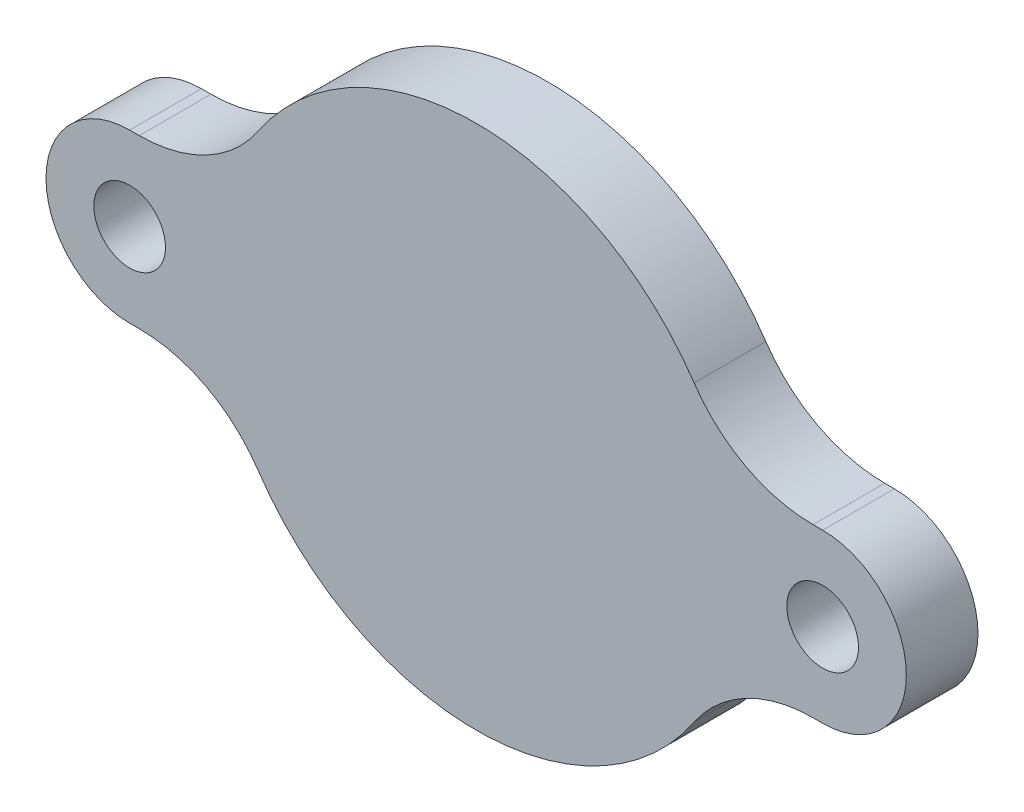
ISO-10303-21;
HEADER;
FILE_DESCRIPTION(('STEP AP214'),'2;1');
FILE_NAME('part.step','',(''),(''),'','','');
FILE_SCHEMA(('AUTOMOTIVE_DESIGN { 1 0 10303 214 1 1 1 1 }'));
ENDSEC;
DATA;
#1=APPLICATION_CONTEXT('core data for automotive mechanical design processes');
#2=APPLICATION_PROTOCOL_DEFINITION('international standard','automotive_design',2000,#1);
#3=PRODUCT_CONTEXT('',#1,'mechanical');
#4=PRODUCT('Part','Part','',(#3));
#5=PRODUCT_RELATED_PRODUCT_CATEGORY('part','',(#4));
#6=PRODUCT_DEFINITION_FORMATION('','',#4);
#7=PRODUCT_DEFINITION_CONTEXT('part definition',#1,'design');
#8=PRODUCT_DEFINITION('design','',#6,#7);
#9=PRODUCT_DEFINITION_SHAPE('','',#8);
#10=(LENGTH_UNIT() NAMED_UNIT(*) SI_UNIT(.MILLI.,.METRE.));
#11=(NAMED_UNIT(*) PLANE_ANGLE_UNIT() SI_UNIT($,.RADIAN.));
#12=(NAMED_UNIT(*) SI_UNIT($,.STERADIAN.) SOLID_ANGLE_UNIT());
#13=UNCERTAINTY_MEASURE_WITH_UNIT(LENGTH_MEASURE(1.E-05),#10,'distance_accuracy_value','');
#14=(GEOMETRIC_REPRESENTATION_CONTEXT(3) GLOBAL_UNCERTAINTY_ASSIGNED_CONTEXT((#13)) GLOBAL_UNIT_ASSIGNED_CONTEXT((#10,
#11,#12)) REPRESENTATION_CONTEXT('',''));
#15=CARTESIAN_POINT('',(0.,0.,0.));
#16=DIRECTION('',(0.,0.,1.));
#17=DIRECTION('',(1.,0.,0.));
#18=AXIS2_PLACEMENT_3D('',#15,#16,#17);
#19=CARTESIAN_POINT('',(14.5,0.,3.));
#20=DIRECTION('',(0.,0.,1.));
#21=DIRECTION('',(1.,0.,0.));
#22=AXIS2_PLACEMENT_3D('',#19,#20,#21);
#23=PLANE('',#22);
#24=CARTESIAN_POINT('',(14.5,0.,3.));
#25=DIRECTION('',(0.,0.,1.));
#26=DIRECTION('',(1.,0.,0.));
#27=AXIS2_PLACEMENT_3D('',#24,#25,#26);
#28=CIRCLE('',#27,1.5);
#29=CARTESIAN_POINT('',(16.,0.,3.));
#30=VERTEX_POINT('',#29);
#31=EDGE_CURVE('E160',#30,#30,#28,.T.);
#32=ORIENTED_EDGE('',*,*,#31,.F.);
#33=EDGE_LOOP('',(#32));
#34=FACE_BOUND('',#33,.T.);
#35=CARTESIAN_POINT('',(14.5,0.,3.));
#36=DIRECTION('',(0.,0.,1.));
#37=DIRECTION('',(1.,0.,0.));
#38=AXIS2_PLACEMENT_3D('',#35,#36,#37);
#39=CIRCLE('',#38,3.5);
#40=CARTESIAN_POINT('',(14.5,-3.5,3.));
#41=VERTEX_POINT('',#40);
#42=CARTESIAN_POINT('',(14.5,3.5,3.));
#43=VERTEX_POINT('',#42);
#44=EDGE_CURVE('E179',#41,#43,#39,.T.);
#45=ORIENTED_EDGE('',*,*,#44,.T.);
#46=DIRECTION('',(-1.,0.,0.));
#47=VECTOR('',#46,1.);
#48=CARTESIAN_POINT('',(14.5,3.5,3.));
#49=LINE('',#48,#47);
#50=CARTESIAN_POINT('',(14.0978721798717,3.5,3.));
#51=VERTEX_POINT('',#50);
#52=EDGE_CURVE('E107',#43,#51,#49,.T.);
#53=ORIENTED_EDGE('',*,*,#52,.T.);
#54=CARTESIAN_POINT('',(14.0978721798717,9.5,3.));
#55=DIRECTION('',(0.,0.,-1.));
#56=DIRECTION('',(1.,0.,0.));
#57=AXIS2_PLACEMENT_3D('',#54,#55,#56);
#58=CIRCLE('',#57,6.);
#59=CARTESIAN_POINT('',(9.1221525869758,6.14705882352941,3.));
#60=VERTEX_POINT('',#59);
#61=EDGE_CURVE('E206',#51,#60,#58,.T.);
#62=ORIENTED_EDGE('',*,*,#61,.T.);
#63=CARTESIAN_POINT('',(0.,0.,3.));
#64=DIRECTION('',(0.,0.,1.));
#65=DIRECTION('',(1.,0.,0.));
#66=AXIS2_PLACEMENT_3D('',#63,#64,#65);
#67=CIRCLE('',#66,11.);
#68=CARTESIAN_POINT('',(-9.1221525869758,6.14705882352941,3.));
#69=VERTEX_POINT('',#68);
#70=EDGE_CURVE('E225',#60,#69,#67,.T.);
#71=ORIENTED_EDGE('',*,*,#70,.T.);
#72=CARTESIAN_POINT('',(-14.0978721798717,9.5,3.));
#73=DIRECTION('',(0.,0.,-1.));
#74=DIRECTION('',(1.,0.,0.));
#75=AXIS2_PLACEMENT_3D('',#72,#73,#74);
#76=CIRCLE('',#75,6.);
#77=CARTESIAN_POINT('',(-14.0978721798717,3.5,3.));
#78=VERTEX_POINT('',#77);
#79=EDGE_CURVE('E222',#69,#78,#76,.T.);
#80=ORIENTED_EDGE('',*,*,#79,.T.);
#81=DIRECTION('',(-1.,0.,0.));
#82=VECTOR('',#81,1.);
#83=CARTESIAN_POINT('',(-14.0978721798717,3.5,3.));
#84=LINE('',#83,#82);
#85=CARTESIAN_POINT('',(-14.5,3.5,3.));
#86=VERTEX_POINT('',#85);
#87=EDGE_CURVE('E224',#78,#86,#84,.T.);
#88=ORIENTED_EDGE('',*,*,#87,.T.);
#89=CARTESIAN_POINT('',(-14.5,0.,3.));
#90=DIRECTION('',(0.,0.,1.));
#91=DIRECTION('',(1.,0.,0.));
#92=AXIS2_PLACEMENT_3D('',#89,#90,#91);
#93=CIRCLE('',#92,3.5);
#94=CARTESIAN_POINT('',(-14.5,-3.5,3.));
#95=VERTEX_POINT('',#94);
#96=EDGE_CURVE('E227',#86,#95,#93,.T.);
#97=ORIENTED_EDGE('',*,*,#96,.T.);
#98=DIRECTION('',(1.,0.,0.));
#99=VECTOR('',#98,1.);
#100=CARTESIAN_POINT('',(-14.5,-3.5,3.));
#101=LINE('',#100,#99);
#102=CARTESIAN_POINT('',(-14.0978721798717,-3.5,3.));
#103=VERTEX_POINT('',#102);
#104=EDGE_CURVE('E233',#95,#103,#101,.T.);
#105=ORIENTED_EDGE('',*,*,#104,.T.);
#106=CARTESIAN_POINT('',(-14.0978721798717,-9.5,3.));
#107=DIRECTION('',(0.,0.,-1.));
#108=DIRECTION('',(1.,0.,0.));
#109=AXIS2_PLACEMENT_3D('',#106,#107,#108);
#110=CIRCLE('',#109,6.);
#111=CARTESIAN_POINT('',(-9.1221525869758,-6.14705882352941,3.));
#112=VERTEX_POINT('',#111);
#113=EDGE_CURVE('E138',#103,#112,#110,.T.);
#114=ORIENTED_EDGE('',*,*,#113,.T.);
#115=CARTESIAN_POINT('',(0.,0.,3.));
#116=DIRECTION('',(0.,0.,1.));
#117=DIRECTION('',(1.,0.,0.));
#118=AXIS2_PLACEMENT_3D('',#115,#116,#117);
#119=CIRCLE('',#118,11.);
#120=CARTESIAN_POINT('',(9.1221525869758,-6.14705882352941,3.));
#121=VERTEX_POINT('',#120);
#122=EDGE_CURVE('E132',#112,#121,#119,.T.);
#123=ORIENTED_EDGE('',*,*,#122,.T.);
#124=CARTESIAN_POINT('',(14.0978721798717,-9.5,3.));
#125=DIRECTION('',(0.,0.,-1.));
#126=DIRECTION('',(1.,0.,0.));
#127=AXIS2_PLACEMENT_3D('',#124,#125,#126);
#128=CIRCLE('',#127,6.);
#129=CARTESIAN_POINT('',(14.0978721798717,-3.5,3.));
#130=VERTEX_POINT('',#129);
#131=EDGE_CURVE('E136',#121,#130,#128,.T.);
#132=ORIENTED_EDGE('',*,*,#131,.T.);
#133=DIRECTION('',(1.,0.,0.));
#134=VECTOR('',#133,1.);
#135=CARTESIAN_POINT('',(14.0978721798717,-3.5,3.));
#136=LINE('',#135,#134);
#137=EDGE_CURVE('E52',#130,#41,#136,.T.);
#138=ORIENTED_EDGE('',*,*,#137,.T.);
#139=EDGE_LOOP('',(#45,#53,#62,#71,#80,#88,#97,#105,#114,#123,#132,#138));
#140=FACE_BOUND('',#139,.T.);
#141=CARTESIAN_POINT('',(-14.5,0.,3.));
#142=DIRECTION('',(0.,0.,1.));
#143=DIRECTION('',(1.,0.,0.));
#144=AXIS2_PLACEMENT_3D('',#141,#142,#143);
#145=CIRCLE('',#144,1.5);
#146=CARTESIAN_POINT('',(-13.,0.,3.));
#147=VERTEX_POINT('',#146);
#148=EDGE_CURVE('E275',#147,#147,#145,.T.);
#149=ORIENTED_EDGE('',*,*,#148,.F.);
#150=EDGE_LOOP('',(#149));
#151=FACE_BOUND('',#150,.T.);
#152=ADVANCED_FACE('F35',(#34,#140,#151),#23,.T.);
#153=CARTESIAN_POINT('',(14.5,0.,0.));
#154=DIRECTION('',(0.,0.,1.));
#155=DIRECTION('',(1.,0.,0.));
#156=AXIS2_PLACEMENT_3D('',#153,#154,#155);
#157=PLANE('',#156);
#158=CARTESIAN_POINT('',(14.5,0.,0.));
#159=DIRECTION('',(0.,0.,1.));
#160=DIRECTION('',(1.,0.,0.));
#161=AXIS2_PLACEMENT_3D('',#158,#159,#160);
#162=CIRCLE('',#161,3.5);
#163=CARTESIAN_POINT('',(14.5,-3.5,0.));
#164=VERTEX_POINT('',#163);
#165=CARTESIAN_POINT('',(14.5,3.5,0.));
#166=VERTEX_POINT('',#165);
#167=EDGE_CURVE('E156',#164,#166,#162,.T.);
#168=ORIENTED_EDGE('',*,*,#167,.F.);
#169=DIRECTION('',(1.,0.,0.));
#170=VECTOR('',#169,1.);
#171=CARTESIAN_POINT('',(14.0978721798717,-3.5,0.));
#172=LINE('',#171,#170);
#173=CARTESIAN_POINT('',(14.0978721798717,-3.5,0.));
#174=VERTEX_POINT('',#173);
#175=EDGE_CURVE('E99',#174,#164,#172,.T.);
#176=ORIENTED_EDGE('',*,*,#175,.F.);
#177=CARTESIAN_POINT('',(14.0978721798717,-9.5,0.));
#178=DIRECTION('',(0.,0.,-1.));
#179=DIRECTION('',(1.,0.,0.));
#180=AXIS2_PLACEMENT_3D('',#177,#178,#179);
#181=CIRCLE('',#180,6.);
#182=CARTESIAN_POINT('',(9.1221525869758,-6.14705882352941,0.));
#183=VERTEX_POINT('',#182);
#184=EDGE_CURVE('E93',#183,#174,#181,.T.);
#185=ORIENTED_EDGE('',*,*,#184,.F.);
#186=CARTESIAN_POINT('',(0.,0.,0.));
#187=DIRECTION('',(0.,0.,1.));
#188=DIRECTION('',(1.,0.,0.));
#189=AXIS2_PLACEMENT_3D('',#186,#187,#188);
#190=CIRCLE('',#189,11.);
#191=CARTESIAN_POINT('',(-9.1221525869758,-6.14705882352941,0.));
#192=VERTEX_POINT('',#191);
#193=EDGE_CURVE('E146',#192,#183,#190,.T.);
#194=ORIENTED_EDGE('',*,*,#193,.F.);
#195=CARTESIAN_POINT('',(-14.0978721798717,-9.5,0.));
#196=DIRECTION('',(0.,0.,-1.));
#197=DIRECTION('',(1.,0.,0.));
#198=AXIS2_PLACEMENT_3D('',#195,#196,#197);
#199=CIRCLE('',#198,6.);
#200=CARTESIAN_POINT('',(-14.0978721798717,-3.5,0.));
#201=VERTEX_POINT('',#200);
#202=EDGE_CURVE('E174',#201,#192,#199,.T.);
#203=ORIENTED_EDGE('',*,*,#202,.F.);
#204=DIRECTION('',(1.,0.,0.));
#205=VECTOR('',#204,1.);
#206=CARTESIAN_POINT('',(-14.5,-3.5,0.));
#207=LINE('',#206,#205);
#208=CARTESIAN_POINT('',(-14.5,-3.5,0.));
#209=VERTEX_POINT('',#208);
#210=EDGE_CURVE('E172',#209,#201,#207,.T.);
#211=ORIENTED_EDGE('',*,*,#210,.F.);
#212=CARTESIAN_POINT('',(-14.5,0.,0.));
#213=DIRECTION('',(0.,0.,1.));
#214=DIRECTION('',(1.,0.,0.));
#215=AXIS2_PLACEMENT_3D('',#212,#213,#214);
#216=CIRCLE('',#215,3.5);
#217=CARTESIAN_POINT('',(-14.5,3.5,0.));
#218=VERTEX_POINT('',#217);
#219=EDGE_CURVE('E170',#218,#209,#216,.T.);
#220=ORIENTED_EDGE('',*,*,#219,.F.);
#221=DIRECTION('',(-1.,0.,0.));
#222=VECTOR('',#221,1.);
#223=CARTESIAN_POINT('',(-14.0978721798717,3.5,0.));
#224=LINE('',#223,#222);
#225=CARTESIAN_POINT('',(-14.0978721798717,3.5,0.));
#226=VERTEX_POINT('',#225);
#227=EDGE_CURVE('E168',#226,#218,#224,.T.);
#228=ORIENTED_EDGE('',*,*,#227,.F.);
#229=CARTESIAN_POINT('',(-14.0978721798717,9.5,0.));
#230=DIRECTION('',(0.,0.,-1.));
#231=DIRECTION('',(1.,0.,0.));
#232=AXIS2_PLACEMENT_3D('',#229,#230,#231);
#233=CIRCLE('',#232,6.);
#234=CARTESIAN_POINT('',(-9.1221525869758,6.14705882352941,0.));
#235=VERTEX_POINT('',#234);
#236=EDGE_CURVE('E166',#235,#226,#233,.T.);
#237=ORIENTED_EDGE('',*,*,#236,.F.);
#238=CARTESIAN_POINT('',(0.,0.,0.));
#239=DIRECTION('',(0.,0.,1.));
#240=DIRECTION('',(1.,0.,0.));
#241=AXIS2_PLACEMENT_3D('',#238,#239,#240);
#242=CIRCLE('',#241,11.);
#243=CARTESIAN_POINT('',(9.1221525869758,6.14705882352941,0.));
#244=VERTEX_POINT('',#243);
#245=EDGE_CURVE('E164',#244,#235,#242,.T.);
#246=ORIENTED_EDGE('',*,*,#245,.F.);
#247=CARTESIAN_POINT('',(14.0978721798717,9.5,0.));
#248=DIRECTION('',(0.,0.,-1.));
#249=DIRECTION('',(1.,0.,0.));
#250=AXIS2_PLACEMENT_3D('',#247,#248,#249);
#251=CIRCLE('',#250,6.);
#252=CARTESIAN_POINT('',(14.0978721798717,3.5,0.));
#253=VERTEX_POINT('',#252);
#254=EDGE_CURVE('E162',#253,#244,#251,.T.);
#255=ORIENTED_EDGE('',*,*,#254,.F.);
#256=DIRECTION('',(-1.,0.,0.));
#257=VECTOR('',#256,1.);
#258=CARTESIAN_POINT('',(14.5,3.5,0.));
#259=LINE('',#258,#257);
#260=EDGE_CURVE('E159',#166,#253,#259,.T.);
#261=ORIENTED_EDGE('',*,*,#260,.F.);
#262=EDGE_LOOP('',(#168,#176,#185,#194,#203,#211,#220,#228,#237,#246,#255,#261));
#263=FACE_BOUND('',#262,.T.);
#264=CARTESIAN_POINT('',(14.5,0.,0.));
#265=DIRECTION('',(0.,0.,1.));
#266=DIRECTION('',(1.,0.,0.));
#267=AXIS2_PLACEMENT_3D('',#264,#265,#266);
#268=CIRCLE('',#267,1.5);
#269=CARTESIAN_POINT('',(16.,0.,0.));
#270=VERTEX_POINT('',#269);
#271=EDGE_CURVE('E281',#270,#270,#268,.T.);
#272=ORIENTED_EDGE('',*,*,#271,.T.);
#273=EDGE_LOOP('',(#272));
#274=FACE_BOUND('',#273,.T.);
#275=CARTESIAN_POINT('',(-14.5,0.,0.));
#276=DIRECTION('',(0.,0.,1.));
#277=DIRECTION('',(1.,0.,0.));
#278=AXIS2_PLACEMENT_3D('',#275,#276,#277);
#279=CIRCLE('',#278,1.5);
#280=CARTESIAN_POINT('',(-13.,0.,0.));
#281=VERTEX_POINT('',#280);
#282=EDGE_CURVE('E278',#281,#281,#279,.T.);
#283=ORIENTED_EDGE('',*,*,#282,.T.);
#284=EDGE_LOOP('',(#283));
#285=FACE_BOUND('',#284,.T.);
#286=ADVANCED_FACE('F210',(#263,#274,#285),#157,.F.);
#287=CARTESIAN_POINT('',(14.5,0.,3.));
#288=DIRECTION('',(0.,0.,-1.));
#289=DIRECTION('',(-1.,0.,0.));
#290=AXIS2_PLACEMENT_3D('',#287,#288,#289);
#291=CYLINDRICAL_SURFACE('',#290,3.5);
#292=ORIENTED_EDGE('',*,*,#167,.T.);
#293=DIRECTION('',(0.,0.,-1.));
#294=VECTOR('',#293,1.);
#295=CARTESIAN_POINT('',(14.5,3.5,3.));
#296=LINE('',#295,#294);
#297=EDGE_CURVE('E11',#43,#166,#296,.T.);
#298=ORIENTED_EDGE('',*,*,#297,.F.);
#299=ORIENTED_EDGE('',*,*,#44,.F.);
#300=DIRECTION('',(0.,0.,-1.));
#301=VECTOR('',#300,1.);
#302=CARTESIAN_POINT('',(14.5,-3.5,3.));
#303=LINE('',#302,#301);
#304=EDGE_CURVE('E152',#41,#164,#303,.T.);
#305=ORIENTED_EDGE('',*,*,#304,.T.);
#306=EDGE_LOOP('',(#292,#298,#299,#305));
#307=FACE_BOUND('',#306,.T.);
#308=ADVANCED_FACE('F37',(#307),#291,.T.);
#309=CARTESIAN_POINT('',(14.5,3.5,3.));
#310=DIRECTION('',(0.,-1.,0.));
#311=DIRECTION('',(1.,0.,0.));
#312=AXIS2_PLACEMENT_3D('',#309,#310,#311);
#313=PLANE('',#312);
#314=ORIENTED_EDGE('',*,*,#260,.T.);
#315=DIRECTION('',(0.,0.,-1.));
#316=VECTOR('',#315,1.);
#317=CARTESIAN_POINT('',(14.0978721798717,3.5,3.));
#318=LINE('',#317,#316);
#319=EDGE_CURVE('E44',#51,#253,#318,.T.);
#320=ORIENTED_EDGE('',*,*,#319,.F.);
#321=ORIENTED_EDGE('',*,*,#52,.F.);
#322=ORIENTED_EDGE('',*,*,#297,.T.);
#323=EDGE_LOOP('',(#314,#320,#321,#322));
#324=FACE_BOUND('',#323,.T.);
#325=ADVANCED_FACE('F374',(#324),#313,.F.);
#326=CARTESIAN_POINT('',(14.0978721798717,9.5,3.));
#327=DIRECTION('',(0.,0.,-1.));
#328=DIRECTION('',(-1.,0.,0.));
#329=AXIS2_PLACEMENT_3D('',#326,#327,#328);
#330=CYLINDRICAL_SURFACE('',#329,6.);
#331=ORIENTED_EDGE('',*,*,#254,.T.);
#332=DIRECTION('',(0.,0.,-1.));
#333=VECTOR('',#332,1.);
#334=CARTESIAN_POINT('',(9.1221525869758,6.14705882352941,3.));
#335=LINE('',#334,#333);
#336=EDGE_CURVE('E198',#60,#244,#335,.T.);
#337=ORIENTED_EDGE('',*,*,#336,.F.);
#338=ORIENTED_EDGE('',*,*,#61,.F.);
#339=ORIENTED_EDGE('',*,*,#319,.T.);
#340=EDGE_LOOP('',(#331,#337,#338,#339));
#341=FACE_BOUND('',#340,.T.);
#342=ADVANCED_FACE('F204',(#341),#330,.F.);
#343=CARTESIAN_POINT('',(0.,0.,3.));
#344=DIRECTION('',(0.,0.,-1.));
#345=DIRECTION('',(-1.,0.,0.));
#346=AXIS2_PLACEMENT_3D('',#343,#344,#345);
#347=CYLINDRICAL_SURFACE('',#346,11.);
#348=ORIENTED_EDGE('',*,*,#245,.T.);
#349=DIRECTION('',(0.,0.,-1.));
#350=VECTOR('',#349,1.);
#351=CARTESIAN_POINT('',(-9.1221525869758,6.14705882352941,3.));
#352=LINE('',#351,#350);
#353=EDGE_CURVE('E195',#69,#235,#352,.T.);
#354=ORIENTED_EDGE('',*,*,#353,.F.);
#355=ORIENTED_EDGE('',*,*,#70,.F.);
#356=ORIENTED_EDGE('',*,*,#336,.T.);
#357=EDGE_LOOP('',(#348,#354,#355,#356));
#358=FACE_BOUND('',#357,.T.);
#359=ADVANCED_FACE('F216',(#358),#347,.T.);
#360=CARTESIAN_POINT('',(-14.0978721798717,9.5,3.));
#361=DIRECTION('',(0.,0.,-1.));
#362=DIRECTION('',(-1.,0.,0.));
#363=AXIS2_PLACEMENT_3D('',#360,#361,#362);
#364=CYLINDRICAL_SURFACE('',#363,6.);
#365=ORIENTED_EDGE('',*,*,#236,.T.);
#366=DIRECTION('',(0.,0.,-1.));
#367=VECTOR('',#366,1.);
#368=CARTESIAN_POINT('',(-14.0978721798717,3.5,3.));
#369=LINE('',#368,#367);
#370=EDGE_CURVE('E192',#78,#226,#369,.T.);
#371=ORIENTED_EDGE('',*,*,#370,.F.);
#372=ORIENTED_EDGE('',*,*,#79,.F.);
#373=ORIENTED_EDGE('',*,*,#353,.T.);
#374=EDGE_LOOP('',(#365,#371,#372,#373));
#375=FACE_BOUND('',#374,.T.);
#376=ADVANCED_FACE('F220',(#375),#364,.F.);
#377=CARTESIAN_POINT('',(-14.0978721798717,3.5,3.));
#378=DIRECTION('',(0.,-1.,0.));
#379=DIRECTION('',(0.,0.,-1.));
#380=AXIS2_PLACEMENT_3D('',#377,#378,#379);
#381=PLANE('',#380);
#382=ORIENTED_EDGE('',*,*,#227,.T.);
#383=DIRECTION('',(0.,0.,-1.));
#384=VECTOR('',#383,1.);
#385=CARTESIAN_POINT('',(-14.5,3.5,3.));
#386=LINE('',#385,#384);
#387=EDGE_CURVE('E189',#86,#218,#386,.T.);
#388=ORIENTED_EDGE('',*,*,#387,.F.);
#389=ORIENTED_EDGE('',*,*,#87,.F.);
#390=ORIENTED_EDGE('',*,*,#370,.T.);
#391=EDGE_LOOP('',(#382,#388,#389,#390));
#392=FACE_BOUND('',#391,.T.);
#393=ADVANCED_FACE('F339',(#392),#381,.F.);
#394=CARTESIAN_POINT('',(-14.5,0.,3.));
#395=DIRECTION('',(0.,0.,-1.));
#396=DIRECTION('',(-1.,0.,0.));
#397=AXIS2_PLACEMENT_3D('',#394,#395,#396);
#398=CYLINDRICAL_SURFACE('',#397,3.5);
#399=ORIENTED_EDGE('',*,*,#219,.T.);
#400=DIRECTION('',(0.,0.,-1.));
#401=VECTOR('',#400,1.);
#402=CARTESIAN_POINT('',(-14.5,-3.5,3.));
#403=LINE('',#402,#401);
#404=EDGE_CURVE('E186',#95,#209,#403,.T.);
#405=ORIENTED_EDGE('',*,*,#404,.F.);
#406=ORIENTED_EDGE('',*,*,#96,.F.);
#407=ORIENTED_EDGE('',*,*,#387,.T.);
#408=EDGE_LOOP('',(#399,#405,#406,#407));
#409=FACE_BOUND('',#408,.T.);
#410=ADVANCED_FACE('F330',(#409),#398,.T.);
#411=CARTESIAN_POINT('',(-14.5,-3.5,3.));
#412=DIRECTION('',(0.,1.,0.));
#413=DIRECTION('',(0.,0.,1.));
#414=AXIS2_PLACEMENT_3D('',#411,#412,#413);
#415=PLANE('',#414);
#416=ORIENTED_EDGE('',*,*,#210,.T.);
#417=DIRECTION('',(0.,0.,-1.));
#418=VECTOR('',#417,1.);
#419=CARTESIAN_POINT('',(-14.0978721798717,-3.5,3.));
#420=LINE('',#419,#418);
#421=EDGE_CURVE('E183',#103,#201,#420,.T.);
#422=ORIENTED_EDGE('',*,*,#421,.F.);
#423=ORIENTED_EDGE('',*,*,#104,.F.);
#424=ORIENTED_EDGE('',*,*,#404,.T.);
#425=EDGE_LOOP('',(#416,#422,#423,#424));
#426=FACE_BOUND('',#425,.T.);
#427=ADVANCED_FACE('F239',(#426),#415,.F.);
#428=CARTESIAN_POINT('',(-14.0978721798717,-9.5,3.));
#429=DIRECTION('',(0.,0.,-1.));
#430=DIRECTION('',(-1.,0.,0.));
#431=AXIS2_PLACEMENT_3D('',#428,#429,#430);
#432=CYLINDRICAL_SURFACE('',#431,6.);
#433=ORIENTED_EDGE('',*,*,#202,.T.);
#434=DIRECTION('',(0.,0.,-1.));
#435=VECTOR('',#434,1.);
#436=CARTESIAN_POINT('',(-9.1221525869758,-6.14705882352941,3.));
#437=LINE('',#436,#435);
#438=EDGE_CURVE('E147',#112,#192,#437,.T.);
#439=ORIENTED_EDGE('',*,*,#438,.F.);
#440=ORIENTED_EDGE('',*,*,#113,.F.);
#441=ORIENTED_EDGE('',*,*,#421,.T.);
#442=EDGE_LOOP('',(#433,#439,#440,#441));
#443=FACE_BOUND('',#442,.T.);
#444=ADVANCED_FACE('F243',(#443),#432,.F.);
#445=CARTESIAN_POINT('',(0.,0.,3.));
#446=DIRECTION('',(0.,0.,-1.));
#447=DIRECTION('',(-1.,0.,0.));
#448=AXIS2_PLACEMENT_3D('',#445,#446,#447);
#449=CYLINDRICAL_SURFACE('',#448,11.);
#450=ORIENTED_EDGE('',*,*,#193,.T.);
#451=DIRECTION('',(0.,0.,-1.));
#452=VECTOR('',#451,1.);
#453=CARTESIAN_POINT('',(9.1221525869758,-6.14705882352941,3.));
#454=LINE('',#453,#452);
#455=EDGE_CURVE('E143',#121,#183,#454,.T.);
#456=ORIENTED_EDGE('',*,*,#455,.F.);
#457=ORIENTED_EDGE('',*,*,#122,.F.);
#458=ORIENTED_EDGE('',*,*,#438,.T.);
#459=EDGE_LOOP('',(#450,#456,#457,#458));
#460=FACE_BOUND('',#459,.T.);
#461=ADVANCED_FACE('F144',(#460),#449,.T.);
#462=CARTESIAN_POINT('',(14.0978721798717,-9.5,3.));
#463=DIRECTION('',(0.,0.,-1.));
#464=DIRECTION('',(-1.,0.,0.));
#465=AXIS2_PLACEMENT_3D('',#462,#463,#464);
#466=CYLINDRICAL_SURFACE('',#465,6.);
#467=ORIENTED_EDGE('',*,*,#184,.T.);
#468=DIRECTION('',(0.,0.,-1.));
#469=VECTOR('',#468,1.);
#470=CARTESIAN_POINT('',(14.0978721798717,-3.5,3.));
#471=LINE('',#470,#469);
#472=EDGE_CURVE('E148',#130,#174,#471,.T.);
#473=ORIENTED_EDGE('',*,*,#472,.F.);
#474=ORIENTED_EDGE('',*,*,#131,.F.);
#475=ORIENTED_EDGE('',*,*,#455,.T.);
#476=EDGE_LOOP('',(#467,#473,#474,#475));
#477=FACE_BOUND('',#476,.T.);
#478=ADVANCED_FACE('F150',(#477),#466,.F.);
#479=CARTESIAN_POINT('',(14.0978721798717,-3.5,3.));
#480=DIRECTION('',(0.,1.,0.));
#481=DIRECTION('',(-1.,0.,0.));
#482=AXIS2_PLACEMENT_3D('',#479,#480,#481);
#483=PLANE('',#482);
#484=ORIENTED_EDGE('',*,*,#175,.T.);
#485=ORIENTED_EDGE('',*,*,#304,.F.);
#486=ORIENTED_EDGE('',*,*,#137,.F.);
#487=ORIENTED_EDGE('',*,*,#472,.T.);
#488=EDGE_LOOP('',(#484,#485,#486,#487));
#489=FACE_BOUND('',#488,.T.);
#490=ADVANCED_FACE('F247',(#489),#483,.F.);
#491=CARTESIAN_POINT('',(14.5,0.,3.));
#492=DIRECTION('',(0.,0.,-1.));
#493=DIRECTION('',(-1.,0.,0.));
#494=AXIS2_PLACEMENT_3D('',#491,#492,#493);
#495=CYLINDRICAL_SURFACE('',#494,1.5);
#496=ORIENTED_EDGE('',*,*,#31,.T.);
#497=EDGE_LOOP('',(#496));
#498=FACE_BOUND('',#497,.T.);
#499=ORIENTED_EDGE('',*,*,#271,.F.);
#500=EDGE_LOOP('',(#499));
#501=FACE_BOUND('',#500,.T.);
#502=ADVANCED_FACE('F249',(#498,#501),#495,.F.);
#503=CARTESIAN_POINT('',(-14.5,0.,3.));
#504=DIRECTION('',(0.,0.,-1.));
#505=DIRECTION('',(-1.,0.,0.));
#506=AXIS2_PLACEMENT_3D('',#503,#504,#505);
#507=CYLINDRICAL_SURFACE('',#506,1.5);
#508=ORIENTED_EDGE('',*,*,#148,.T.);
#509=EDGE_LOOP('',(#508));
#510=FACE_BOUND('',#509,.T.);
#511=ORIENTED_EDGE('',*,*,#282,.F.);
#512=EDGE_LOOP('',(#511));
#513=FACE_BOUND('',#512,.T.);
#514=ADVANCED_FACE('F255',(#510,#513),#507,.F.);
#515=CLOSED_SHELL('',(#152,#286,#308,#325,#342,#359,#376,#393,#410,#427,#444,#461,#478,#490,
#502,#514));
#516=MANIFOLD_SOLID_BREP('B2',#515);
#517=ADVANCED_BREP_SHAPE_REPRESENTATION('',(#18,#516),#14);
#518=SHAPE_DEFINITION_REPRESENTATION(#9,#517);
ENDSEC;
END-ISO-10303-21;
